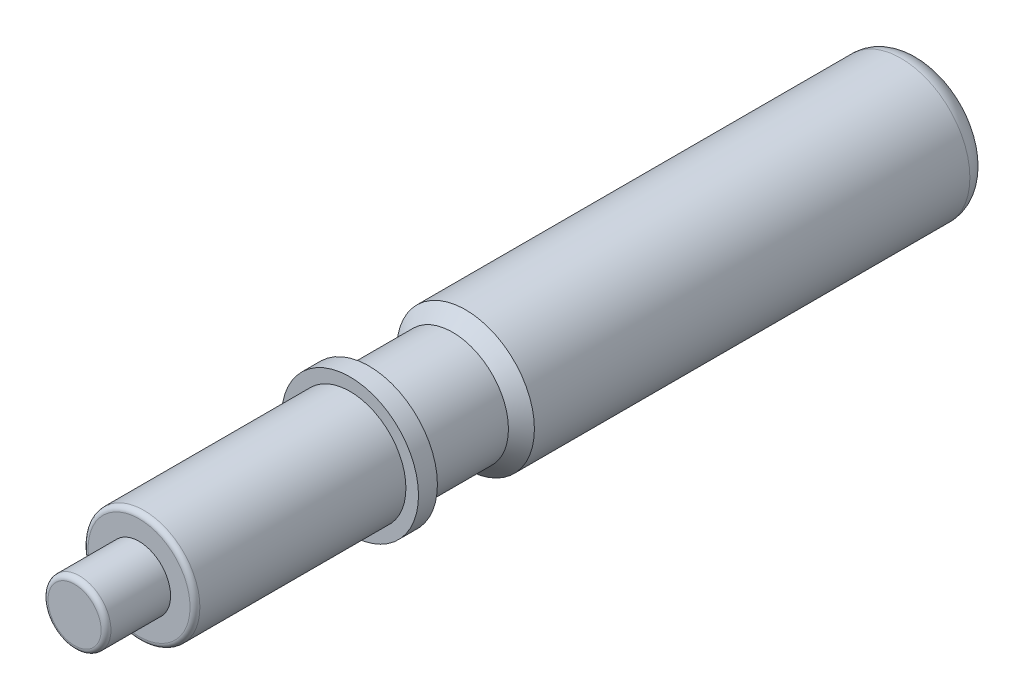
ISO-10303-21;
HEADER;
FILE_DESCRIPTION(('STEP AP214'),'2;1');
FILE_NAME('part.step','',(''),(''),'','','');
FILE_SCHEMA(('AUTOMOTIVE_DESIGN { 1 0 10303 214 1 1 1 1 }'));
ENDSEC;
DATA;
#1=APPLICATION_CONTEXT('core data for automotive mechanical design processes');
#2=APPLICATION_PROTOCOL_DEFINITION('international standard','automotive_design',2000,#1);
#3=PRODUCT_CONTEXT('',#1,'mechanical');
#4=PRODUCT('Part','Part','',(#3));
#5=PRODUCT_RELATED_PRODUCT_CATEGORY('part','',(#4));
#6=PRODUCT_DEFINITION_FORMATION('','',#4);
#7=PRODUCT_DEFINITION_CONTEXT('part definition',#1,'design');
#8=PRODUCT_DEFINITION('design','',#6,#7);
#9=PRODUCT_DEFINITION_SHAPE('','',#8);
#10=(LENGTH_UNIT() NAMED_UNIT(*) SI_UNIT(.MILLI.,.METRE.));
#11=(NAMED_UNIT(*) PLANE_ANGLE_UNIT() SI_UNIT($,.RADIAN.));
#12=(NAMED_UNIT(*) SI_UNIT($,.STERADIAN.) SOLID_ANGLE_UNIT());
#13=UNCERTAINTY_MEASURE_WITH_UNIT(LENGTH_MEASURE(1.E-05),#10,'distance_accuracy_value','');
#14=(GEOMETRIC_REPRESENTATION_CONTEXT(3) GLOBAL_UNCERTAINTY_ASSIGNED_CONTEXT((#13)) GLOBAL_UNIT_ASSIGNED_CONTEXT((#10,
#11,#12)) REPRESENTATION_CONTEXT('',''));
#15=CARTESIAN_POINT('',(0.,0.,0.));
#16=DIRECTION('',(0.,0.,1.));
#17=DIRECTION('',(1.,0.,0.));
#18=AXIS2_PLACEMENT_3D('',#15,#16,#17);
#19=CARTESIAN_POINT('',(0.,2.143125,0.));
#20=DIRECTION('',(0.,0.,-1.));
#21=DIRECTION('',(-1.,0.,0.));
#22=AXIS2_PLACEMENT_3D('',#19,#20,#21);
#23=PLANE('',#22);
#24=CARTESIAN_POINT('',(0.,0.,0.));
#25=DIRECTION('',(0.,0.,1.));
#26=DIRECTION('',(1.,0.,0.));
#27=AXIS2_PLACEMENT_3D('',#24,#25,#26);
#28=CIRCLE('',#27,2.143125);
#29=CARTESIAN_POINT('',(2.143125,0.,0.));
#30=VERTEX_POINT('',#29);
#31=EDGE_CURVE('E78',#30,#30,#28,.T.);
#32=ORIENTED_EDGE('',*,*,#31,.T.);
#33=EDGE_LOOP('',(#32));
#34=FACE_BOUND('',#33,.T.);
#35=ADVANCED_FACE('F35',(#34),#23,.F.);
#36=CARTESIAN_POINT('',(0.,0.,-68.2625));
#37=DIRECTION('',(0.,0.,1.));
#38=DIRECTION('',(1.,0.,0.));
#39=AXIS2_PLACEMENT_3D('',#36,#37,#38);
#40=PLANE('',#39);
#41=CARTESIAN_POINT('',(0.,0.,-68.2625));
#42=DIRECTION('',(0.,0.,1.));
#43=DIRECTION('',(1.,0.,0.));
#44=AXIS2_PLACEMENT_3D('',#41,#42,#43);
#45=CIRCLE('',#44,3.96874999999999);
#46=CARTESIAN_POINT('',(3.96874999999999,0.,-68.2625));
#47=VERTEX_POINT('',#46);
#48=EDGE_CURVE('E10',#47,#47,#45,.T.);
#49=ORIENTED_EDGE('',*,*,#48,.F.);
#50=EDGE_LOOP('',(#49));
#51=FACE_BOUND('',#50,.T.);
#52=ADVANCED_FACE('F150',(#51),#40,.F.);
#53=CARTESIAN_POINT('',(0.,0.,-66.675));
#54=DIRECTION('',(0.,0.,1.));
#55=DIRECTION('',(1.,0.,0.));
#56=AXIS2_PLACEMENT_3D('',#53,#54,#55);
#57=TOROIDAL_SURFACE('',#56,3.96875,1.5875);
#58=CARTESIAN_POINT('',(0.,0.,-66.675));
#59=DIRECTION('',(0.,0.,1.));
#60=DIRECTION('',(1.,0.,0.));
#61=AXIS2_PLACEMENT_3D('',#58,#59,#60);
#62=CIRCLE('',#61,5.55625);
#63=CARTESIAN_POINT('',(5.55625,0.,-66.675));
#64=VERTEX_POINT('',#63);
#65=EDGE_CURVE('E41',#64,#64,#62,.T.);
#66=ORIENTED_EDGE('',*,*,#65,.F.);
#67=EDGE_LOOP('',(#66));
#68=FACE_BOUND('',#67,.T.);
#69=ORIENTED_EDGE('',*,*,#48,.T.);
#70=EDGE_LOOP('',(#69));
#71=FACE_BOUND('',#70,.T.);
#72=ADVANCED_FACE('F145',(#68,#71),#57,.T.);
#73=CARTESIAN_POINT('',(0.,0.,0.));
#74=DIRECTION('',(0.,0.,1.));
#75=DIRECTION('',(1.,0.,0.));
#76=AXIS2_PLACEMENT_3D('',#73,#74,#75);
#77=CYLINDRICAL_SURFACE('',#76,5.55625);
#78=CARTESIAN_POINT('',(0.,0.,-31.543625));
#79=DIRECTION('',(0.,0.,1.));
#80=DIRECTION('',(1.,0.,0.));
#81=AXIS2_PLACEMENT_3D('',#78,#79,#80);
#82=CIRCLE('',#81,5.55625);
#83=CARTESIAN_POINT('',(5.55625,0.,-31.543625));
#84=VERTEX_POINT('',#83);
#85=EDGE_CURVE('E45',#84,#84,#82,.T.);
#86=ORIENTED_EDGE('',*,*,#85,.F.);
#87=EDGE_LOOP('',(#86));
#88=FACE_BOUND('',#87,.T.);
#89=ORIENTED_EDGE('',*,*,#65,.T.);
#90=EDGE_LOOP('',(#89));
#91=FACE_BOUND('',#90,.T.);
#92=ADVANCED_FACE('F140',(#88,#91),#77,.T.);
#93=CARTESIAN_POINT('',(0.,0.,-31.543625));
#94=DIRECTION('',(0.,0.,-1.));
#95=DIRECTION('',(-1.,0.,0.));
#96=AXIS2_PLACEMENT_3D('',#93,#94,#95);
#97=CONICAL_SURFACE('',#96,5.55625,0.78539816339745);
#98=CARTESIAN_POINT('',(0.,0.,-30.495875));
#99=DIRECTION('',(0.,0.,1.));
#100=DIRECTION('',(1.,0.,0.));
#101=AXIS2_PLACEMENT_3D('',#98,#99,#100);
#102=CIRCLE('',#101,4.5085);
#103=CARTESIAN_POINT('',(4.5085,0.,-30.495875));
#104=VERTEX_POINT('',#103);
#105=EDGE_CURVE('E49',#104,#104,#102,.T.);
#106=ORIENTED_EDGE('',*,*,#105,.F.);
#107=EDGE_LOOP('',(#106));
#108=FACE_BOUND('',#107,.T.);
#109=ORIENTED_EDGE('',*,*,#85,.T.);
#110=EDGE_LOOP('',(#109));
#111=FACE_BOUND('',#110,.T.);
#112=ADVANCED_FACE('F134',(#108,#111),#97,.T.);
#113=CARTESIAN_POINT('',(0.,0.,0.));
#114=DIRECTION('',(0.,0.,1.));
#115=DIRECTION('',(1.,0.,0.));
#116=AXIS2_PLACEMENT_3D('',#113,#114,#115);
#117=CYLINDRICAL_SURFACE('',#116,4.5085);
#118=CARTESIAN_POINT('',(0.,0.,-23.749));
#119=DIRECTION('',(0.,0.,1.));
#120=DIRECTION('',(1.,0.,0.));
#121=AXIS2_PLACEMENT_3D('',#118,#119,#120);
#122=CIRCLE('',#121,4.5085);
#123=CARTESIAN_POINT('',(4.5085,0.,-23.749));
#124=VERTEX_POINT('',#123);
#125=EDGE_CURVE('E54',#124,#124,#122,.T.);
#126=ORIENTED_EDGE('',*,*,#125,.F.);
#127=EDGE_LOOP('',(#126));
#128=FACE_BOUND('',#127,.T.);
#129=ORIENTED_EDGE('',*,*,#105,.T.);
#130=EDGE_LOOP('',(#129));
#131=FACE_BOUND('',#130,.T.);
#132=ADVANCED_FACE('F128',(#128,#131),#117,.T.);
#133=CARTESIAN_POINT('',(0.,4.5085,-23.749));
#134=DIRECTION('',(0.,0.,1.));
#135=DIRECTION('',(1.,0.,0.));
#136=AXIS2_PLACEMENT_3D('',#133,#134,#135);
#137=PLANE('',#136);
#138=CARTESIAN_POINT('',(0.,0.,-23.749));
#139=DIRECTION('',(0.,0.,1.));
#140=DIRECTION('',(1.,0.,0.));
#141=AXIS2_PLACEMENT_3D('',#138,#139,#140);
#142=CIRCLE('',#141,5.5245);
#143=CARTESIAN_POINT('',(5.5245,0.,-23.749));
#144=VERTEX_POINT('',#143);
#145=EDGE_CURVE('E57',#144,#144,#142,.T.);
#146=ORIENTED_EDGE('',*,*,#145,.F.);
#147=EDGE_LOOP('',(#146));
#148=FACE_BOUND('',#147,.T.);
#149=ORIENTED_EDGE('',*,*,#125,.T.);
#150=EDGE_LOOP('',(#149));
#151=FACE_BOUND('',#150,.T.);
#152=ADVANCED_FACE('F122',(#148,#151),#137,.F.);
#153=CARTESIAN_POINT('',(0.,0.,0.));
#154=DIRECTION('',(0.,0.,1.));
#155=DIRECTION('',(1.,0.,0.));
#156=AXIS2_PLACEMENT_3D('',#153,#154,#155);
#157=CYLINDRICAL_SURFACE('',#156,5.5245);
#158=CARTESIAN_POINT('',(0.,0.,-22.225));
#159=DIRECTION('',(0.,0.,1.));
#160=DIRECTION('',(1.,0.,0.));
#161=AXIS2_PLACEMENT_3D('',#158,#159,#160);
#162=CIRCLE('',#161,5.5245);
#163=CARTESIAN_POINT('',(5.5245,0.,-22.225));
#164=VERTEX_POINT('',#163);
#165=EDGE_CURVE('E60',#164,#164,#162,.T.);
#166=ORIENTED_EDGE('',*,*,#165,.F.);
#167=EDGE_LOOP('',(#166));
#168=FACE_BOUND('',#167,.T.);
#169=ORIENTED_EDGE('',*,*,#145,.T.);
#170=EDGE_LOOP('',(#169));
#171=FACE_BOUND('',#170,.T.);
#172=ADVANCED_FACE('F116',(#168,#171),#157,.T.);
#173=CARTESIAN_POINT('',(0.,5.5245,-22.225));
#174=DIRECTION('',(0.,0.,-1.));
#175=DIRECTION('',(-1.,0.,0.));
#176=AXIS2_PLACEMENT_3D('',#173,#174,#175);
#177=PLANE('',#176);
#178=CARTESIAN_POINT('',(0.,0.,-22.225));
#179=DIRECTION('',(0.,0.,1.));
#180=DIRECTION('',(1.,0.,0.));
#181=AXIS2_PLACEMENT_3D('',#178,#179,#180);
#182=CIRCLE('',#181,4.5085);
#183=CARTESIAN_POINT('',(4.5085,0.,-22.225));
#184=VERTEX_POINT('',#183);
#185=EDGE_CURVE('E63',#184,#184,#182,.T.);
#186=ORIENTED_EDGE('',*,*,#185,.F.);
#187=EDGE_LOOP('',(#186));
#188=FACE_BOUND('',#187,.T.);
#189=ORIENTED_EDGE('',*,*,#165,.T.);
#190=EDGE_LOOP('',(#189));
#191=FACE_BOUND('',#190,.T.);
#192=ADVANCED_FACE('F110',(#188,#191),#177,.F.);
#193=CARTESIAN_POINT('',(0.,0.,0.));
#194=DIRECTION('',(0.,0.,1.));
#195=DIRECTION('',(1.,0.,0.));
#196=AXIS2_PLACEMENT_3D('',#193,#194,#195);
#197=CYLINDRICAL_SURFACE('',#196,4.5085);
#198=CARTESIAN_POINT('',(0.,0.,-5.603875));
#199=DIRECTION('',(0.,0.,1.));
#200=DIRECTION('',(1.,0.,0.));
#201=AXIS2_PLACEMENT_3D('',#198,#199,#200);
#202=CIRCLE('',#201,4.5085);
#203=CARTESIAN_POINT('',(4.5085,0.,-5.603875));
#204=VERTEX_POINT('',#203);
#205=EDGE_CURVE('E66',#204,#204,#202,.T.);
#206=ORIENTED_EDGE('',*,*,#205,.F.);
#207=EDGE_LOOP('',(#206));
#208=FACE_BOUND('',#207,.T.);
#209=ORIENTED_EDGE('',*,*,#185,.T.);
#210=EDGE_LOOP('',(#209));
#211=FACE_BOUND('',#210,.T.);
#212=ADVANCED_FACE('F104',(#208,#211),#197,.T.);
#213=CARTESIAN_POINT('',(0.,0.,-5.603875));
#214=DIRECTION('',(0.,0.,1.));
#215=DIRECTION('',(1.,0.,0.));
#216=AXIS2_PLACEMENT_3D('',#213,#214,#215);
#217=TOROIDAL_SURFACE('',#216,4.111625,0.396875);
#218=CARTESIAN_POINT('',(0.,0.,-5.207));
#219=DIRECTION('',(0.,0.,1.));
#220=DIRECTION('',(1.,0.,0.));
#221=AXIS2_PLACEMENT_3D('',#218,#219,#220);
#222=CIRCLE('',#221,4.11162499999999);
#223=CARTESIAN_POINT('',(4.11162499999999,0.,-5.207));
#224=VERTEX_POINT('',#223);
#225=EDGE_CURVE('E69',#224,#224,#222,.T.);
#226=ORIENTED_EDGE('',*,*,#225,.F.);
#227=EDGE_LOOP('',(#226));
#228=FACE_BOUND('',#227,.T.);
#229=ORIENTED_EDGE('',*,*,#205,.T.);
#230=EDGE_LOOP('',(#229));
#231=FACE_BOUND('',#230,.T.);
#232=ADVANCED_FACE('F98',(#228,#231),#217,.T.);
#233=CARTESIAN_POINT('',(0.,4.11162499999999,-5.207));
#234=DIRECTION('',(0.,0.,-1.));
#235=DIRECTION('',(-1.,0.,0.));
#236=AXIS2_PLACEMENT_3D('',#233,#234,#235);
#237=PLANE('',#236);
#238=CARTESIAN_POINT('',(0.,0.,-5.207));
#239=DIRECTION('',(0.,0.,1.));
#240=DIRECTION('',(1.,0.,0.));
#241=AXIS2_PLACEMENT_3D('',#238,#239,#240);
#242=CIRCLE('',#241,2.54);
#243=CARTESIAN_POINT('',(2.54,0.,-5.207));
#244=VERTEX_POINT('',#243);
#245=EDGE_CURVE('E72',#244,#244,#242,.T.);
#246=ORIENTED_EDGE('',*,*,#245,.F.);
#247=EDGE_LOOP('',(#246));
#248=FACE_BOUND('',#247,.T.);
#249=ORIENTED_EDGE('',*,*,#225,.T.);
#250=EDGE_LOOP('',(#249));
#251=FACE_BOUND('',#250,.T.);
#252=ADVANCED_FACE('F92',(#248,#251),#237,.F.);
#253=CARTESIAN_POINT('',(0.,0.,0.));
#254=DIRECTION('',(0.,0.,1.));
#255=DIRECTION('',(1.,0.,0.));
#256=AXIS2_PLACEMENT_3D('',#253,#254,#255);
#257=CYLINDRICAL_SURFACE('',#256,2.54);
#258=CARTESIAN_POINT('',(0.,0.,-0.396875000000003));
#259=DIRECTION('',(0.,0.,1.));
#260=DIRECTION('',(1.,0.,0.));
#261=AXIS2_PLACEMENT_3D('',#258,#259,#260);
#262=CIRCLE('',#261,2.54);
#263=CARTESIAN_POINT('',(2.54,0.,-0.396875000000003));
#264=VERTEX_POINT('',#263);
#265=EDGE_CURVE('E75',#264,#264,#262,.T.);
#266=ORIENTED_EDGE('',*,*,#265,.F.);
#267=EDGE_LOOP('',(#266));
#268=FACE_BOUND('',#267,.T.);
#269=ORIENTED_EDGE('',*,*,#245,.T.);
#270=EDGE_LOOP('',(#269));
#271=FACE_BOUND('',#270,.T.);
#272=ADVANCED_FACE('F86',(#268,#271),#257,.T.);
#273=CARTESIAN_POINT('',(0.,0.,-0.396875));
#274=DIRECTION('',(0.,0.,1.));
#275=DIRECTION('',(1.,0.,0.));
#276=AXIS2_PLACEMENT_3D('',#273,#274,#275);
#277=TOROIDAL_SURFACE('',#276,2.143125,0.396875);
#278=ORIENTED_EDGE('',*,*,#31,.F.);
#279=EDGE_LOOP('',(#278));
#280=FACE_BOUND('',#279,.T.);
#281=ORIENTED_EDGE('',*,*,#265,.T.);
#282=EDGE_LOOP('',(#281));
#283=FACE_BOUND('',#282,.T.);
#284=ADVANCED_FACE('F83',(#280,#283),#277,.T.);
#285=CLOSED_SHELL('',(#35,#52,#72,#92,#112,#132,#152,#172,#192,#212,#232,#252,#272,#284));
#286=MANIFOLD_SOLID_BREP('B2',#285);
#287=ADVANCED_BREP_SHAPE_REPRESENTATION('',(#18,#286),#14);
#288=SHAPE_DEFINITION_REPRESENTATION(#9,#287);
ENDSEC;
END-ISO-10303-21;
